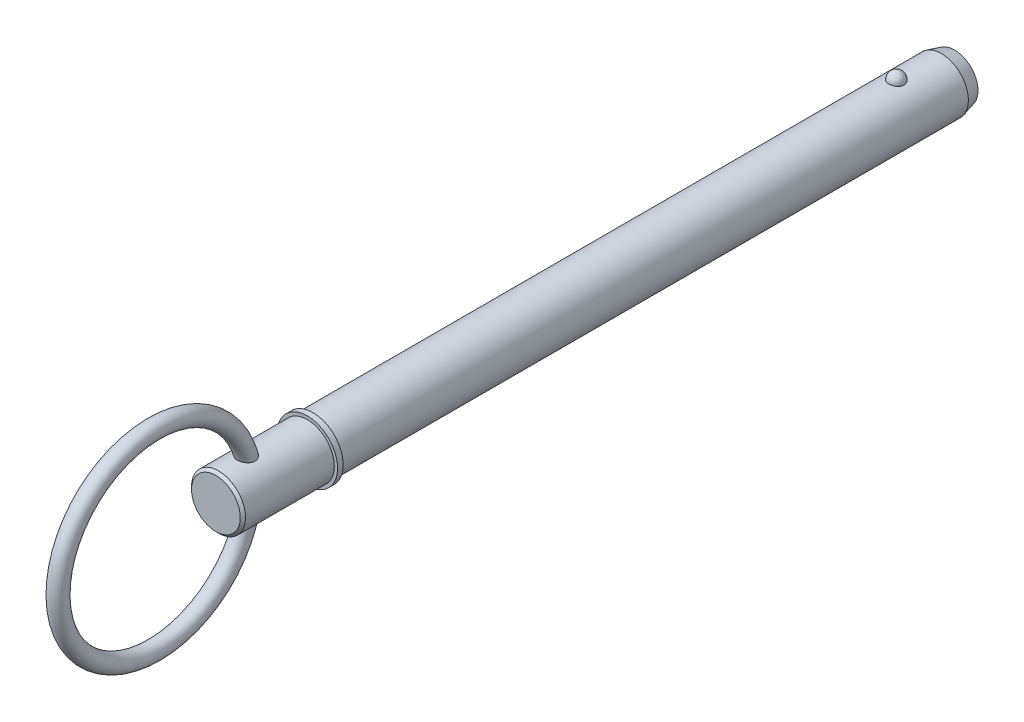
from build123d import *

# Parameters (mm, degrees)
SKETCH2_R           = 7.145
BOSS_EXTRUDE1_DEPTH = 152.4
BOSS_EXTRUDE2_START = 17.45
SKETCH3_R           = 7.145
BOSS_EXTRUDE2_DEPTH = 17.45
CHAMFER1_SIZE       = 3.5
CHAMFER1_SIZE2      = 0.937822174
SKETCH20_W          = 1.5
SKETCH20_H          = 8
SKETCH21_R          = 7.145
BOSS_EXTRUDE3_DEPTH = 25.7
CHAMFER2_SIZE       = 0.7
SKETCH24_R          = 2.25


with BuildPart() as part:
    # Sketch2 → Boss-Extrude1 (new body)
    with BuildSketch(Plane.XY):
        with Locations(Location((0, 0, 0), (0, 0, 180))):
            Circle(SKETCH2_R)
    extrude(amount=BOSS_EXTRUDE1_DEPTH)

    # Sketch3 → Boss-Extrude2 (add)
    with BuildSketch(Plane(origin=(0, 0, 0), x_dir=(-1, 0, 0), z_dir=(0, 0, -1)).offset(BOSS_EXTRUDE2_START)):
        Circle(SKETCH3_R)
    extrude(amount=-BOSS_EXTRUDE2_DEPTH)

    # Chamfer1
    chamfer1_edges = [part.edges().sort_by_distance(p)[0] for p in [
        (7.145, 0, -17.45),
    ]]
    chamfer1_side = [part.faces().sort_by_distance(p)[0] for p in [
        (7.145, 0, 67.475),
    ]]
    chamfer(chamfer1_edges, length=CHAMFER1_SIZE, length2=CHAMFER1_SIZE2, reference=chamfer1_side[0])

    # Sketch18 → Revolve1 (revolve)
    with BuildSketch(Plane(origin=(0, 0, 0), x_dir=(0, 0, -1), z_dir=(1, 0, 0))):
        with BuildLine():
            Line((2.02, 9.165), (2.02, 5.125))
            ThreePointArc((2.02, 5.125), (0, 7.145), (2.02, 9.165))
        make_face()
    revolve(axis=Axis((0, 9.165, -2.02), (0, -1, 0)))

    # Sketch20 → Revolve2 (revolve)
    with BuildSketch(Plane(origin=(0, 0, 0), x_dir=(0, 0, -1), z_dir=(1, 0, 0)), mode=Mode.PRIVATE) as revolve2_sk:
        with Locations((-153.15, 4)):
            Rectangle(SKETCH20_W, SKETCH20_H)
    revolve(revolve2_sk.sketch.rotate(Axis((0, 0, 33.728787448), (0, 0, 1)), 90), axis=Axis((0, 0, 33.728787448), (0, 0, 1)))

    # Sketch21 → Boss-Extrude3 (add)
    with BuildSketch(Plane(origin=(0, 0, 152.4), x_dir=(-1, 0, 0), z_dir=(0, 0, -1))):
        Circle(SKETCH21_R)
    extrude(amount=-BOSS_EXTRUDE3_DEPTH)

    # Chamfer2
    chamfer2_edges = [part.edges().sort_by_distance(p)[0] for p in [
        (7.145, 0, 178.1),
    ]]
    chamfer(chamfer2_edges, length=CHAMFER2_SIZE)

    # Sweep1: sweep along a path in Sketch23
    with BuildLine(Plane(origin=(0, 0, 0), x_dir=(0, 0, -1), z_dir=(1, 0, 0))) as sweep1_path:
        CenterArc((-194.5, 0), 25.4, 0, 360)
    # Sketch24 → Sweep1 (sweep)
    with BuildSketch(Plane(origin=(0, 0, 0), x_dir=(1, 0, 0), z_dir=(0, 1, 0))):
        with Locations((0, -169.1)):
            Circle(SKETCH24_R)
    sweep(path=sweep1_path.line)


solid = part.part
